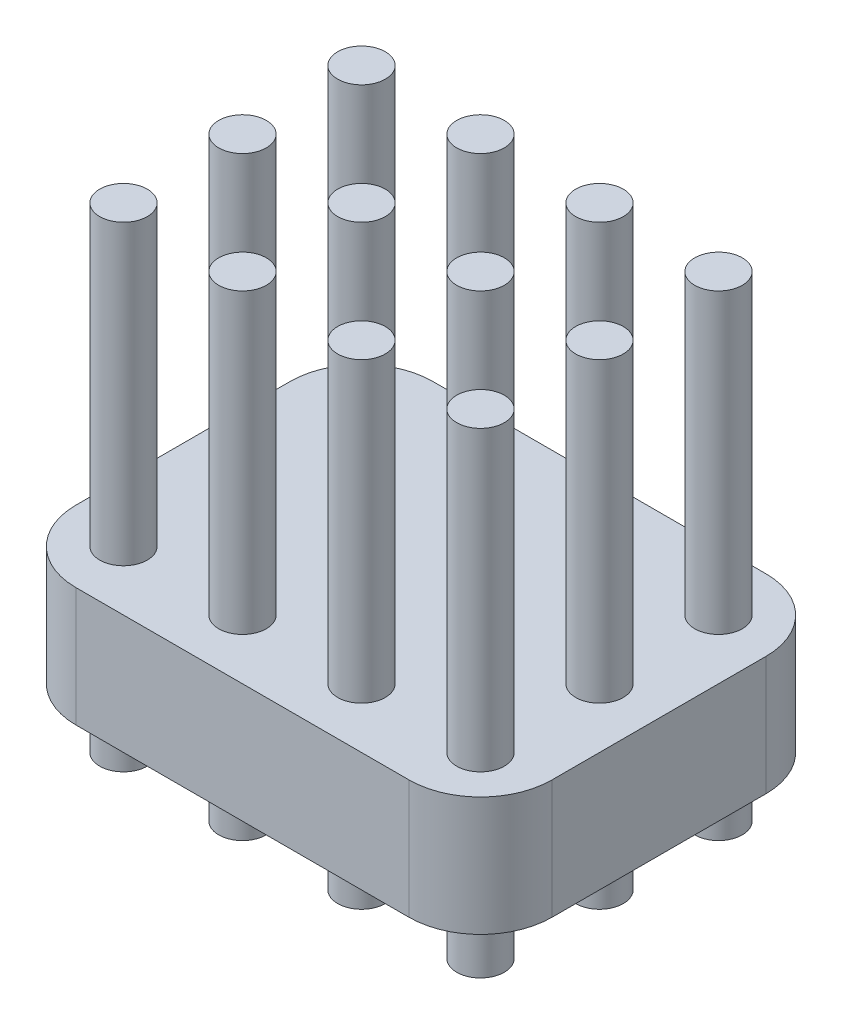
from build123d import *

# Parameters (mm, degrees)
SKIZZE1_W                       = 20
SKIZZE1_H                       = 15
AUFSATZ_LINEAR_AUSTRAGEN1_DEPTH = 2.5
AUFSATZ_LINEAR_START            = -5
SKIZZE2_R                       = 1
AUFSATZ_LINEAR_AUSTRAGEN2_DEPTH = 20
LINEARES_MUSTER1_COUNT          = 4
LINEARES_MUSTER1_PITCH          = 5
LINEARES_MUSTER1_COUNT_DIR2     = 3
LINEARES_MUSTER1_PITCH_DIR2     = 5
VERRUNDUNG1_R                   = 3


with BuildPart() as part:
    # Skizze1 → Aufsatz-Linear austragen1 (new, symmetric)
    with BuildSketch(Plane(origin=(0, 0, 0), x_dir=(1, 0, 0), z_dir=(0, 1, 0))):
        Rectangle(SKIZZE1_W, SKIZZE1_H)
    extrude(amount=AUFSATZ_LINEAR_AUSTRAGEN1_DEPTH, both=True)


with BuildPart() as body_2:
    # Skizze2 → Aufsatz-Linear austragen2 (new body)
    with BuildSketch(Plane(origin=(0, 0, 0), x_dir=(1, 0, 0), z_dir=(0, 1, 0)).offset(AUFSATZ_LINEAR_START)):
        with Locations(Location((-7.5, 5, 0), (0, 0, 270))):
            Circle(SKIZZE2_R)
    aufsatz_linear_austragen2 = extrude(amount=AUFSATZ_LINEAR_AUSTRAGEN2_DEPTH)


with BuildPart() as part_1:
    add(part.part)

    # Lineares Muster1: Aufsatz-Linear austragen2 4 × 3
    with Locations(*[(i * LINEARES_MUSTER1_PITCH, 0, j * LINEARES_MUSTER1_PITCH_DIR2) for i in range(LINEARES_MUSTER1_COUNT) for j in range(LINEARES_MUSTER1_COUNT_DIR2) if (i, j) != (0, 0)]):
        add(aufsatz_linear_austragen2)

    # Verrundung1
    verrundung1_edges = [part_1.edges().sort_by_distance(p)[0] for p in [
        (-10, 0, -7.5),
        (10, 0, -7.5),
        (10, 0, 7.5),
        (-10, 0, 7.5),
    ]]
    fillet(verrundung1_edges, radius=VERRUNDUNG1_R)


solid = Compound([body_2.part, part_1.part])
